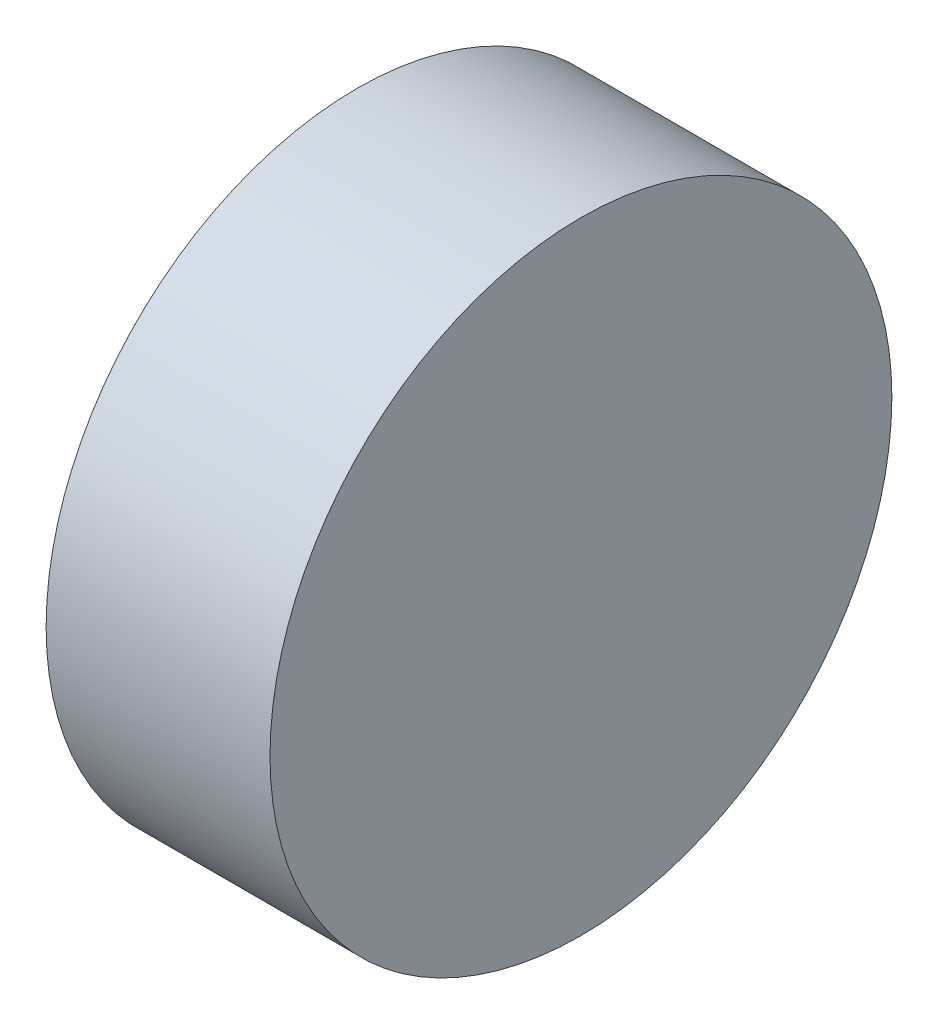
from build123d import *

# Parameters (mm, degrees)
ESQUISSE1_W = 27
ESQUISSE1_H = 37.5


with BuildPart() as part:
    # Esquisse1 → R_volution1 (revolve)
    with BuildSketch(Plane.XY, mode=Mode.PRIVATE) as r_volution1_sk:
        with Locations((13.5, 18.75)):
            Rectangle(ESQUISSE1_W, ESQUISSE1_H)
    revolve(r_volution1_sk.sketch.rotate(Axis((0, 0, 0), (1, 0, 0)), 90), axis=Axis((0, 0, 0), (1, 0, 0)))


solid = part.part
